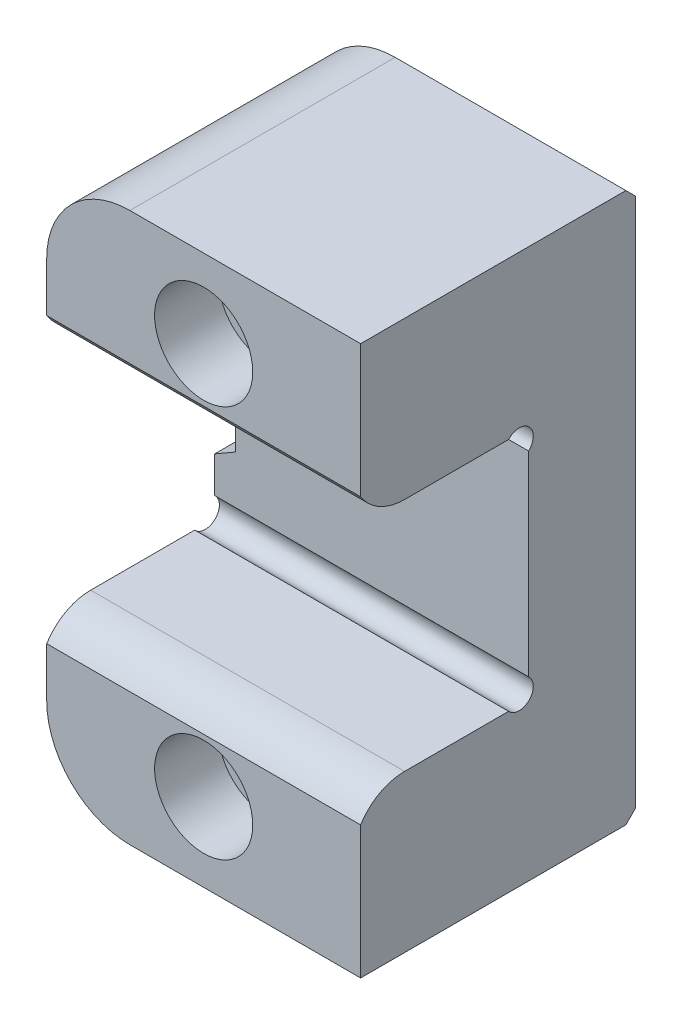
ISO-10303-21;
HEADER;
FILE_DESCRIPTION(('STEP AP214'),'2;1');
FILE_NAME('part.step','',(''),(''),'','','');
FILE_SCHEMA(('AUTOMOTIVE_DESIGN { 1 0 10303 214 1 1 1 1 }'));
ENDSEC;
DATA;
#1=APPLICATION_CONTEXT('core data for automotive mechanical design processes');
#2=APPLICATION_PROTOCOL_DEFINITION('international standard','automotive_design',2000,#1);
#3=PRODUCT_CONTEXT('',#1,'mechanical');
#4=PRODUCT('Part','Part','',(#3));
#5=PRODUCT_RELATED_PRODUCT_CATEGORY('part','',(#4));
#6=PRODUCT_DEFINITION_FORMATION('','',#4);
#7=PRODUCT_DEFINITION_CONTEXT('part definition',#1,'design');
#8=PRODUCT_DEFINITION('design','',#6,#7);
#9=PRODUCT_DEFINITION_SHAPE('','',#8);
#10=(LENGTH_UNIT() NAMED_UNIT(*) SI_UNIT(.MILLI.,.METRE.));
#11=(NAMED_UNIT(*) PLANE_ANGLE_UNIT() SI_UNIT($,.RADIAN.));
#12=(NAMED_UNIT(*) SI_UNIT($,.STERADIAN.) SOLID_ANGLE_UNIT());
#13=UNCERTAINTY_MEASURE_WITH_UNIT(LENGTH_MEASURE(1.E-05),#10,'distance_accuracy_value','');
#14=(GEOMETRIC_REPRESENTATION_CONTEXT(3) GLOBAL_UNCERTAINTY_ASSIGNED_CONTEXT((#13)) GLOBAL_UNIT_ASSIGNED_CONTEXT((#10,
#11,#12)) REPRESENTATION_CONTEXT('',''));
#15=CARTESIAN_POINT('',(0.,0.,0.));
#16=DIRECTION('',(0.,0.,1.));
#17=DIRECTION('',(1.,0.,0.));
#18=AXIS2_PLACEMENT_3D('',#15,#16,#17);
#19=CARTESIAN_POINT('',(25.4,19.05,-27.178));
#20=DIRECTION('',(0.,0.,-1.));
#21=DIRECTION('',(-1.,0.,0.));
#22=AXIS2_PLACEMENT_3D('',#19,#20,#21);
#23=PLANE('',#22);
#24=DIRECTION('',(-0.866025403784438,0.500000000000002,0.));
#25=VECTOR('',#24,1.);
#26=CARTESIAN_POINT('',(8.7739915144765,-9.74709142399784,-27.178));
#27=LINE('',#26,#25);
#28=CARTESIAN_POINT('',(-21.9978635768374,8.0190473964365,-27.178));
#29=VERTEX_POINT('',#28);
#30=CARTESIAN_POINT('',(-25.4,9.98327177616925,-27.178));
#31=VERTEX_POINT('',#30);
#32=EDGE_CURVE('E340',#29,#31,#27,.T.);
#33=ORIENTED_EDGE('',*,*,#32,.F.);
#34=DIRECTION('',(0.,-1.,0.));
#35=VECTOR('',#34,1.);
#36=CARTESIAN_POINT('',(-21.9978635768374,-8.60845644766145,-27.178));
#37=LINE('',#36,#35);
#38=CARTESIAN_POINT('',(-21.9978635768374,-8.0190473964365,-27.178));
#39=VERTEX_POINT('',#38);
#40=EDGE_CURVE('E255',#29,#39,#37,.T.);
#41=ORIENTED_EDGE('',*,*,#40,.T.);
#42=DIRECTION('',(0.866025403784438,0.500000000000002,0.));
#43=VECTOR('',#42,1.);
#44=CARTESIAN_POINT('',(25.2717754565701,19.2720914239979,-27.178));
#45=LINE('',#44,#43);
#46=CARTESIAN_POINT('',(-25.4,-9.98327177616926,-27.178));
#47=VERTEX_POINT('',#46);
#48=EDGE_CURVE('E338',#47,#39,#45,.T.);
#49=ORIENTED_EDGE('',*,*,#48,.F.);
#50=DIRECTION('',(0.,-1.,0.));
#51=VECTOR('',#50,1.);
#52=CARTESIAN_POINT('',(-25.4,19.05,-27.178));
#53=LINE('',#52,#51);
#54=CARTESIAN_POINT('',(-25.4,-15.8221162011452,-27.178));
#55=VERTEX_POINT('',#54);
#56=EDGE_CURVE('E221',#47,#55,#53,.T.);
#57=ORIENTED_EDGE('',*,*,#56,.T.);
#58=DIRECTION('',(1.,0.,0.));
#59=VECTOR('',#58,1.);
#60=CARTESIAN_POINT('',(-25.4,-15.8221162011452,-27.178));
#61=LINE('',#60,#59);
#62=CARTESIAN_POINT('',(25.4,-15.8221162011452,-27.178));
#63=VERTEX_POINT('',#62);
#64=EDGE_CURVE('E194',#55,#63,#61,.T.);
#65=ORIENTED_EDGE('',*,*,#64,.T.);
#66=DIRECTION('',(0.,-1.,0.));
#67=VECTOR('',#66,1.);
#68=CARTESIAN_POINT('',(25.4,19.05,-27.178));
#69=LINE('',#68,#67);
#70=CARTESIAN_POINT('',(25.4,15.8221162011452,-27.178));
#71=VERTEX_POINT('',#70);
#72=EDGE_CURVE('E348',#71,#63,#69,.T.);
#73=ORIENTED_EDGE('',*,*,#72,.F.);
#74=DIRECTION('',(1.,0.,0.));
#75=VECTOR('',#74,1.);
#76=CARTESIAN_POINT('',(-25.4,15.8221162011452,-27.178));
#77=LINE('',#76,#75);
#78=CARTESIAN_POINT('',(-25.4,15.8221162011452,-27.178));
#79=VERTEX_POINT('',#78);
#80=EDGE_CURVE('E416',#71,#79,#77,.F.);
#81=ORIENTED_EDGE('',*,*,#80,.T.);
#82=EDGE_CURVE('E215',#79,#31,#53,.T.);
#83=ORIENTED_EDGE('',*,*,#82,.T.);
#84=EDGE_LOOP('',(#33,#41,#49,#57,#65,#73,#81,#83));
#85=FACE_BOUND('',#84,.T.);
#86=ADVANCED_FACE('F32',(#85),#23,.F.);
#87=CARTESIAN_POINT('',(25.4,44.45,-44.45));
#88=DIRECTION('',(0.,0.,1.));
#89=DIRECTION('',(1.,0.,0.));
#90=AXIS2_PLACEMENT_3D('',#87,#88,#89);
#91=PLANE('',#90);
#92=CARTESIAN_POINT('',(0.,31.75,-44.45));
#93=DIRECTION('',(0.,0.,1.));
#94=DIRECTION('',(1.,0.,0.));
#95=AXIS2_PLACEMENT_3D('',#92,#93,#94);
#96=CIRCLE('',#95,5.15873999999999);
#97=CARTESIAN_POINT('',(5.15873999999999,31.75,-44.45));
#98=VERTEX_POINT('',#97);
#99=EDGE_CURVE('E723',#98,#98,#96,.T.);
#100=ORIENTED_EDGE('',*,*,#99,.T.);
#101=EDGE_LOOP('',(#100));
#102=FACE_BOUND('',#101,.T.);
#103=CARTESIAN_POINT('',(0.,-31.75,-44.45));
#104=DIRECTION('',(0.,0.,1.));
#105=DIRECTION('',(1.,0.,0.));
#106=AXIS2_PLACEMENT_3D('',#103,#104,#105);
#107=CIRCLE('',#106,5.15873999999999);
#108=CARTESIAN_POINT('',(5.15873999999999,-31.75,-44.45));
#109=VERTEX_POINT('',#108);
#110=EDGE_CURVE('E709',#109,#109,#107,.T.);
#111=ORIENTED_EDGE('',*,*,#110,.T.);
#112=EDGE_LOOP('',(#111));
#113=FACE_BOUND('',#112,.T.);
#114=CARTESIAN_POINT('',(-11.938,-30.988,-44.45));
#115=DIRECTION('',(0.,0.,1.));
#116=DIRECTION('',(1.,0.,0.));
#117=AXIS2_PLACEMENT_3D('',#114,#115,#116);
#118=CIRCLE('',#117,11.938);
#119=CARTESIAN_POINT('',(-11.938,-42.926,-44.45));
#120=VERTEX_POINT('',#119);
#121=CARTESIAN_POINT('',(-23.876,-30.988,-44.45));
#122=VERTEX_POINT('',#121);
#123=EDGE_CURVE('E271',#120,#122,#118,.F.);
#124=ORIENTED_EDGE('',*,*,#123,.T.);
#125=DIRECTION('',(0.,1.,0.));
#126=VECTOR('',#125,1.);
#127=CARTESIAN_POINT('',(-23.876,-9.98327177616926,-44.45));
#128=LINE('',#127,#126);
#129=CARTESIAN_POINT('',(-23.876,-9.10338996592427,-44.45));
#130=VERTEX_POINT('',#129);
#131=EDGE_CURVE('E273',#122,#130,#128,.T.);
#132=ORIENTED_EDGE('',*,*,#131,.T.);
#133=DIRECTION('',(0.866025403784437,0.500000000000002,0.));
#134=VECTOR('',#133,1.);
#135=CARTESIAN_POINT('',(-23.01875,-8.60845644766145,-44.45));
#136=LINE('',#135,#134);
#137=CARTESIAN_POINT('',(-23.01875,-8.60845644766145,-44.45));
#138=VERTEX_POINT('',#137);
#139=EDGE_CURVE('E324',#130,#138,#136,.T.);
#140=ORIENTED_EDGE('',*,*,#139,.T.);
#141=DIRECTION('',(0.,1.,0.));
#142=VECTOR('',#141,1.);
#143=CARTESIAN_POINT('',(-23.01875,8.60845644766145,-44.45));
#144=LINE('',#143,#142);
#145=CARTESIAN_POINT('',(-23.01875,8.60845644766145,-44.45));
#146=VERTEX_POINT('',#145);
#147=EDGE_CURVE('E323',#138,#146,#144,.T.);
#148=ORIENTED_EDGE('',*,*,#147,.T.);
#149=DIRECTION('',(-0.866025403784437,0.500000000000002,0.));
#150=VECTOR('',#149,1.);
#151=CARTESIAN_POINT('',(-23.01875,8.60845644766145,-44.45));
#152=LINE('',#151,#150);
#153=CARTESIAN_POINT('',(-23.876,9.10338996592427,-44.45));
#154=VERTEX_POINT('',#153);
#155=EDGE_CURVE('E317',#146,#154,#152,.T.);
#156=ORIENTED_EDGE('',*,*,#155,.T.);
#157=DIRECTION('',(0.,1.,0.));
#158=VECTOR('',#157,1.);
#159=CARTESIAN_POINT('',(-23.876,30.988,-44.45));
#160=LINE('',#159,#158);
#161=CARTESIAN_POINT('',(-23.876,30.988,-44.45));
#162=VERTEX_POINT('',#161);
#163=EDGE_CURVE('E265',#154,#162,#160,.T.);
#164=ORIENTED_EDGE('',*,*,#163,.T.);
#165=CARTESIAN_POINT('',(-11.938,30.988,-44.45));
#166=DIRECTION('',(0.,0.,1.));
#167=DIRECTION('',(1.,0.,0.));
#168=AXIS2_PLACEMENT_3D('',#165,#166,#167);
#169=CIRCLE('',#168,11.938);
#170=CARTESIAN_POINT('',(-11.938,42.926,-44.45));
#171=VERTEX_POINT('',#170);
#172=EDGE_CURVE('E263',#162,#171,#169,.F.);
#173=ORIENTED_EDGE('',*,*,#172,.T.);
#174=DIRECTION('',(1.,0.,0.));
#175=VECTOR('',#174,1.);
#176=CARTESIAN_POINT('',(25.4,42.926,-44.45));
#177=LINE('',#176,#175);
#178=CARTESIAN_POINT('',(25.4,42.926,-44.45));
#179=VERTEX_POINT('',#178);
#180=EDGE_CURVE('E267',#171,#179,#177,.T.);
#181=ORIENTED_EDGE('',*,*,#180,.T.);
#182=DIRECTION('',(0.,1.,0.));
#183=VECTOR('',#182,1.);
#184=CARTESIAN_POINT('',(25.4,44.45,-44.45));
#185=LINE('',#184,#183);
#186=CARTESIAN_POINT('',(25.4,-42.926,-44.45));
#187=VERTEX_POINT('',#186);
#188=EDGE_CURVE('E357',#187,#179,#185,.T.);
#189=ORIENTED_EDGE('',*,*,#188,.F.);
#190=DIRECTION('',(-1.,0.,0.));
#191=VECTOR('',#190,1.);
#192=CARTESIAN_POINT('',(25.4,-42.926,-44.45));
#193=LINE('',#192,#191);
#194=EDGE_CURVE('E269',#187,#120,#193,.T.);
#195=ORIENTED_EDGE('',*,*,#194,.T.);
#196=EDGE_LOOP('',(#124,#132,#140,#148,#156,#164,#173,#181,#189,#195));
#197=FACE_BOUND('',#196,.T.);
#198=ADVANCED_FACE('F321',(#102,#113,#197),#91,.F.);
#199=CARTESIAN_POINT('',(-25.4,-19.05,0.));
#200=DIRECTION('',(-1.,0.,0.));
#201=DIRECTION('',(0.,0.,1.));
#202=AXIS2_PLACEMENT_3D('',#199,#200,#201);
#203=PLANE('',#202);
#204=DIRECTION('',(0.,0.,1.));
#205=VECTOR('',#204,1.);
#206=CARTESIAN_POINT('',(-25.4,30.988,-44.45));
#207=LINE('',#206,#205);
#208=CARTESIAN_POINT('',(-25.4,30.988,0.));
#209=VERTEX_POINT('',#208);
#210=CARTESIAN_POINT('',(-25.4,30.988,-42.926));
#211=VERTEX_POINT('',#210);
#212=EDGE_CURVE('E235',#209,#211,#207,.F.);
#213=ORIENTED_EDGE('',*,*,#212,.T.);
#214=DIRECTION('',(0.,-1.,0.));
#215=VECTOR('',#214,1.);
#216=CARTESIAN_POINT('',(-25.4,9.98327177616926,-42.926));
#217=LINE('',#216,#215);
#218=CARTESIAN_POINT('',(-25.4,9.98327177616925,-42.926));
#219=VERTEX_POINT('',#218);
#220=EDGE_CURVE('E49',#211,#219,#217,.T.);
#221=ORIENTED_EDGE('',*,*,#220,.T.);
#222=DIRECTION('',(0.,0.,1.));
#223=VECTOR('',#222,1.);
#224=CARTESIAN_POINT('',(-25.4,9.98327177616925,0.));
#225=LINE('',#224,#223);
#226=EDGE_CURVE('E247',#219,#31,#225,.T.);
#227=ORIENTED_EDGE('',*,*,#226,.T.);
#228=ORIENTED_EDGE('',*,*,#82,.F.);
#229=CARTESIAN_POINT('',(-25.4,17.526,-25.654));
#230=DIRECTION('',(1.,0.,0.));
#231=DIRECTION('',(0.,0.,-1.));
#232=AXIS2_PLACEMENT_3D('',#229,#230,#231);
#233=CIRCLE('',#232,2.286);
#234=CARTESIAN_POINT('',(-25.4,19.05,-23.9501162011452));
#235=VERTEX_POINT('',#234);
#236=EDGE_CURVE('E423',#79,#235,#233,.T.);
#237=ORIENTED_EDGE('',*,*,#236,.T.);
#238=DIRECTION('',(0.,0.,-1.));
#239=VECTOR('',#238,1.);
#240=CARTESIAN_POINT('',(-25.4,19.05,0.));
#241=LINE('',#240,#239);
#242=CARTESIAN_POINT('',(-25.4,19.05,-7.11199999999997));
#243=VERTEX_POINT('',#242);
#244=EDGE_CURVE('E362',#243,#235,#241,.T.);
#245=ORIENTED_EDGE('',*,*,#244,.F.);
#246=CARTESIAN_POINT('',(-25.4,27.4328930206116,-7.11199999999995));
#247=DIRECTION('',(-1.,0.,0.));
#248=DIRECTION('',(0.,0.,-1.));
#249=AXIS2_PLACEMENT_3D('',#246,#247,#248);
#250=CIRCLE('',#249,8.38289302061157);
#251=CARTESIAN_POINT('',(-25.4,22.995286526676,0.));
#252=VERTEX_POINT('',#251);
#253=EDGE_CURVE('E415',#243,#252,#250,.T.);
#254=ORIENTED_EDGE('',*,*,#253,.T.);
#255=DIRECTION('',(0.,-1.,0.));
#256=VECTOR('',#255,1.);
#257=CARTESIAN_POINT('',(-25.4,44.45,0.));
#258=LINE('',#257,#256);
#259=EDGE_CURVE('E342',#209,#252,#258,.T.);
#260=ORIENTED_EDGE('',*,*,#259,.F.);
#261=EDGE_LOOP('',(#213,#221,#227,#228,#237,#245,#254,#260));
#262=FACE_BOUND('',#261,.T.);
#263=ADVANCED_FACE('F459',(#262),#203,.T.);
#264=DIRECTION('',(0.,0.,-1.));
#265=VECTOR('',#264,1.);
#266=CARTESIAN_POINT('',(-25.4,-9.98327177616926,0.));
#267=LINE('',#266,#265);
#268=CARTESIAN_POINT('',(-25.4,-9.98327177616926,-42.926));
#269=VERTEX_POINT('',#268);
#270=EDGE_CURVE('E245',#47,#269,#267,.T.);
#271=ORIENTED_EDGE('',*,*,#270,.T.);
#272=DIRECTION('',(0.,-1.,0.));
#273=VECTOR('',#272,1.);
#274=CARTESIAN_POINT('',(-25.4,-30.988,-42.926));
#275=LINE('',#274,#273);
#276=CARTESIAN_POINT('',(-25.4,-30.988,-42.926));
#277=VERTEX_POINT('',#276);
#278=EDGE_CURVE('E278',#269,#277,#275,.T.);
#279=ORIENTED_EDGE('',*,*,#278,.T.);
#280=DIRECTION('',(0.,0.,-1.));
#281=VECTOR('',#280,1.);
#282=CARTESIAN_POINT('',(-25.4,-30.988,0.));
#283=LINE('',#282,#281);
#284=CARTESIAN_POINT('',(-25.4,-30.988,0.));
#285=VERTEX_POINT('',#284);
#286=EDGE_CURVE('E237',#277,#285,#283,.F.);
#287=ORIENTED_EDGE('',*,*,#286,.T.);
#288=DIRECTION('',(0.,-1.,0.));
#289=VECTOR('',#288,1.);
#290=CARTESIAN_POINT('',(-25.4,-19.05,0.));
#291=LINE('',#290,#289);
#292=CARTESIAN_POINT('',(-25.4,-22.995286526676,0.));
#293=VERTEX_POINT('',#292);
#294=EDGE_CURVE('E214',#293,#285,#291,.T.);
#295=ORIENTED_EDGE('',*,*,#294,.F.);
#296=CARTESIAN_POINT('',(-25.4,-27.4328930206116,-7.11199999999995));
#297=DIRECTION('',(-1.,0.,0.));
#298=DIRECTION('',(0.,0.,1.));
#299=AXIS2_PLACEMENT_3D('',#296,#297,#298);
#300=CIRCLE('',#299,8.38289302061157);
#301=CARTESIAN_POINT('',(-25.4,-19.05,-7.11199999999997));
#302=VERTEX_POINT('',#301);
#303=EDGE_CURVE('E213',#293,#302,#300,.T.);
#304=ORIENTED_EDGE('',*,*,#303,.T.);
#305=DIRECTION('',(0.,0.,1.));
#306=VECTOR('',#305,1.);
#307=CARTESIAN_POINT('',(-25.4,-19.05,-27.178));
#308=LINE('',#307,#306);
#309=CARTESIAN_POINT('',(-25.4,-19.05,-23.9501162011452));
#310=VERTEX_POINT('',#309);
#311=EDGE_CURVE('E205',#310,#302,#308,.T.);
#312=ORIENTED_EDGE('',*,*,#311,.F.);
#313=CARTESIAN_POINT('',(-25.4,-17.526,-25.654));
#314=DIRECTION('',(1.,0.,0.));
#315=DIRECTION('',(0.,0.,1.));
#316=AXIS2_PLACEMENT_3D('',#313,#314,#315);
#317=CIRCLE('',#316,2.286);
#318=EDGE_CURVE('E188',#310,#55,#317,.T.);
#319=ORIENTED_EDGE('',*,*,#318,.T.);
#320=ORIENTED_EDGE('',*,*,#56,.F.);
#321=EDGE_LOOP('',(#271,#279,#287,#295,#304,#312,#319,#320));
#322=FACE_BOUND('',#321,.T.);
#323=ADVANCED_FACE('F211',(#322),#203,.T.);
#324=CARTESIAN_POINT('',(25.4,44.45,0.));
#325=DIRECTION('',(0.,0.,-1.));
#326=DIRECTION('',(0.,1.,0.));
#327=AXIS2_PLACEMENT_3D('',#324,#325,#326);
#328=PLANE('',#327);
#329=CARTESIAN_POINT('',(0.,31.75,0.));
#330=DIRECTION('',(0.,0.,1.));
#331=DIRECTION('',(1.,0.,0.));
#332=AXIS2_PLACEMENT_3D('',#329,#330,#331);
#333=CIRCLE('',#332,7.9375);
#334=CARTESIAN_POINT('',(7.9375,31.75,0.));
#335=VERTEX_POINT('',#334);
#336=EDGE_CURVE('E298',#335,#335,#333,.T.);
#337=ORIENTED_EDGE('',*,*,#336,.F.);
#338=EDGE_LOOP('',(#337));
#339=FACE_BOUND('',#338,.T.);
#340=ORIENTED_EDGE('',*,*,#259,.T.);
#341=DIRECTION('',(1.,0.,0.));
#342=VECTOR('',#341,1.);
#343=CARTESIAN_POINT('',(-25.4,22.995286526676,0.));
#344=LINE('',#343,#342);
#345=CARTESIAN_POINT('',(25.4,22.995286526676,0.));
#346=VERTEX_POINT('',#345);
#347=EDGE_CURVE('E410',#252,#346,#344,.T.);
#348=ORIENTED_EDGE('',*,*,#347,.T.);
#349=DIRECTION('',(0.,-1.,0.));
#350=VECTOR('',#349,1.);
#351=CARTESIAN_POINT('',(25.4,44.45,0.));
#352=LINE('',#351,#350);
#353=CARTESIAN_POINT('',(25.4,44.45,0.));
#354=VERTEX_POINT('',#353);
#355=EDGE_CURVE('E218',#354,#346,#352,.T.);
#356=ORIENTED_EDGE('',*,*,#355,.F.);
#357=DIRECTION('',(-1.,0.,0.));
#358=VECTOR('',#357,1.);
#359=CARTESIAN_POINT('',(25.4,44.45,0.));
#360=LINE('',#359,#358);
#361=CARTESIAN_POINT('',(-11.938,44.45,0.));
#362=VERTEX_POINT('',#361);
#363=EDGE_CURVE('E225',#354,#362,#360,.T.);
#364=ORIENTED_EDGE('',*,*,#363,.T.);
#365=CARTESIAN_POINT('',(-11.938,30.988,0.));
#366=DIRECTION('',(0.,0.,-1.));
#367=DIRECTION('',(0.,1.,0.));
#368=AXIS2_PLACEMENT_3D('',#365,#366,#367);
#369=CIRCLE('',#368,13.462);
#370=EDGE_CURVE('E243',#362,#209,#369,.F.);
#371=ORIENTED_EDGE('',*,*,#370,.T.);
#372=EDGE_LOOP('',(#340,#348,#356,#364,#371));
#373=FACE_BOUND('',#372,.T.);
#374=ADVANCED_FACE('F409',(#339,#373),#328,.F.);
#375=CARTESIAN_POINT('',(25.4,19.05,0.));
#376=DIRECTION('',(0.,1.,0.));
#377=DIRECTION('',(0.,0.,1.));
#378=AXIS2_PLACEMENT_3D('',#375,#376,#377);
#379=PLANE('',#378);
#380=ORIENTED_EDGE('',*,*,#244,.T.);
#381=DIRECTION('',(1.,0.,0.));
#382=VECTOR('',#381,1.);
#383=CARTESIAN_POINT('',(-25.4,19.05,-23.9501162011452));
#384=LINE('',#383,#382);
#385=CARTESIAN_POINT('',(25.4,19.05,-23.9501162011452));
#386=VERTEX_POINT('',#385);
#387=EDGE_CURVE('E420',#235,#386,#384,.T.);
#388=ORIENTED_EDGE('',*,*,#387,.T.);
#389=DIRECTION('',(0.,0.,-1.));
#390=VECTOR('',#389,1.);
#391=CARTESIAN_POINT('',(25.4,19.05,0.));
#392=LINE('',#391,#390);
#393=CARTESIAN_POINT('',(25.4,19.05,-7.11199999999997));
#394=VERTEX_POINT('',#393);
#395=EDGE_CURVE('E345',#394,#386,#392,.T.);
#396=ORIENTED_EDGE('',*,*,#395,.F.);
#397=DIRECTION('',(1.,0.,0.));
#398=VECTOR('',#397,1.);
#399=CARTESIAN_POINT('',(-25.4,19.05,-7.11199999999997));
#400=LINE('',#399,#398);
#401=EDGE_CURVE('E419',#243,#394,#400,.T.);
#402=ORIENTED_EDGE('',*,*,#401,.F.);
#403=EDGE_LOOP('',(#380,#388,#396,#402));
#404=FACE_BOUND('',#403,.T.);
#405=ADVANCED_FACE('F418',(#404),#379,.F.);
#406=CARTESIAN_POINT('',(25.4,-19.05,-27.178));
#407=DIRECTION('',(0.,-1.,0.));
#408=DIRECTION('',(0.,0.,-1.));
#409=AXIS2_PLACEMENT_3D('',#406,#407,#408);
#410=PLANE('',#409);
#411=DIRECTION('',(0.,0.,1.));
#412=VECTOR('',#411,1.);
#413=CARTESIAN_POINT('',(25.4,-19.05,-27.178));
#414=LINE('',#413,#412);
#415=CARTESIAN_POINT('',(25.4,-19.05,-23.9501162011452));
#416=VERTEX_POINT('',#415);
#417=CARTESIAN_POINT('',(25.4,-19.05,-7.11199999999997));
#418=VERTEX_POINT('',#417);
#419=EDGE_CURVE('E207',#416,#418,#414,.T.);
#420=ORIENTED_EDGE('',*,*,#419,.F.);
#421=DIRECTION('',(1.,0.,0.));
#422=VECTOR('',#421,1.);
#423=CARTESIAN_POINT('',(-25.4,-19.05,-23.9501162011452));
#424=LINE('',#423,#422);
#425=EDGE_CURVE('E191',#416,#310,#424,.F.);
#426=ORIENTED_EDGE('',*,*,#425,.T.);
#427=ORIENTED_EDGE('',*,*,#311,.T.);
#428=DIRECTION('',(1.,0.,0.));
#429=VECTOR('',#428,1.);
#430=CARTESIAN_POINT('',(-25.4,-19.05,-7.11199999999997));
#431=LINE('',#430,#429);
#432=EDGE_CURVE('E328',#302,#418,#431,.T.);
#433=ORIENTED_EDGE('',*,*,#432,.T.);
#434=EDGE_LOOP('',(#420,#426,#427,#433));
#435=FACE_BOUND('',#434,.T.);
#436=ADVANCED_FACE('F203',(#435),#410,.F.);
#437=CARTESIAN_POINT('',(25.4,-19.05,0.));
#438=DIRECTION('',(0.,0.,-1.));
#439=DIRECTION('',(0.,1.,0.));
#440=AXIS2_PLACEMENT_3D('',#437,#438,#439);
#441=PLANE('',#440);
#442=CARTESIAN_POINT('',(0.,-31.75,0.));
#443=DIRECTION('',(0.,0.,1.));
#444=DIRECTION('',(1.,0.,0.));
#445=AXIS2_PLACEMENT_3D('',#442,#443,#444);
#446=CIRCLE('',#445,7.9375);
#447=CARTESIAN_POINT('',(7.9375,-31.75,0.));
#448=VERTEX_POINT('',#447);
#449=EDGE_CURVE('E720',#448,#448,#446,.T.);
#450=ORIENTED_EDGE('',*,*,#449,.F.);
#451=EDGE_LOOP('',(#450));
#452=FACE_BOUND('',#451,.T.);
#453=DIRECTION('',(0.,-1.,0.));
#454=VECTOR('',#453,1.);
#455=CARTESIAN_POINT('',(25.4,-19.05,0.));
#456=LINE('',#455,#454);
#457=CARTESIAN_POINT('',(25.4,-22.995286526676,0.));
#458=VERTEX_POINT('',#457);
#459=CARTESIAN_POINT('',(25.4,-44.45,0.));
#460=VERTEX_POINT('',#459);
#461=EDGE_CURVE('E352',#458,#460,#456,.T.);
#462=ORIENTED_EDGE('',*,*,#461,.F.);
#463=DIRECTION('',(1.,0.,0.));
#464=VECTOR('',#463,1.);
#465=CARTESIAN_POINT('',(-25.4,-22.995286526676,0.));
#466=LINE('',#465,#464);
#467=EDGE_CURVE('E325',#293,#458,#466,.T.);
#468=ORIENTED_EDGE('',*,*,#467,.F.);
#469=ORIENTED_EDGE('',*,*,#294,.T.);
#470=CARTESIAN_POINT('',(-11.938,-30.988,0.));
#471=DIRECTION('',(0.,0.,-1.));
#472=DIRECTION('',(0.,1.,0.));
#473=AXIS2_PLACEMENT_3D('',#470,#471,#472);
#474=CIRCLE('',#473,13.462);
#475=CARTESIAN_POINT('',(-11.938,-44.45,0.));
#476=VERTEX_POINT('',#475);
#477=EDGE_CURVE('E239',#285,#476,#474,.F.);
#478=ORIENTED_EDGE('',*,*,#477,.T.);
#479=DIRECTION('',(-1.,0.,0.));
#480=VECTOR('',#479,1.);
#481=CARTESIAN_POINT('',(25.4,-44.45,0.));
#482=LINE('',#481,#480);
#483=EDGE_CURVE('E228',#460,#476,#482,.T.);
#484=ORIENTED_EDGE('',*,*,#483,.F.);
#485=EDGE_LOOP('',(#462,#468,#469,#478,#484));
#486=FACE_BOUND('',#485,.T.);
#487=ADVANCED_FACE('F443',(#452,#486),#441,.F.);
#488=CARTESIAN_POINT('',(25.4,-44.45,0.));
#489=DIRECTION('',(0.,1.,0.));
#490=DIRECTION('',(0.,0.,1.));
#491=AXIS2_PLACEMENT_3D('',#488,#489,#490);
#492=PLANE('',#491);
#493=DIRECTION('',(0.,0.,-1.));
#494=VECTOR('',#493,1.);
#495=CARTESIAN_POINT('',(-11.938,-44.45,-44.45));
#496=LINE('',#495,#494);
#497=CARTESIAN_POINT('',(-11.938,-44.45,-42.926));
#498=VERTEX_POINT('',#497);
#499=EDGE_CURVE('E232',#476,#498,#496,.T.);
#500=ORIENTED_EDGE('',*,*,#499,.T.);
#501=DIRECTION('',(1.,0.,0.));
#502=VECTOR('',#501,1.);
#503=CARTESIAN_POINT('',(25.4,-44.45,-42.926));
#504=LINE('',#503,#502);
#505=CARTESIAN_POINT('',(25.4,-44.45,-42.926));
#506=VERTEX_POINT('',#505);
#507=EDGE_CURVE('E282',#498,#506,#504,.T.);
#508=ORIENTED_EDGE('',*,*,#507,.T.);
#509=DIRECTION('',(0.,0.,-1.));
#510=VECTOR('',#509,1.);
#511=CARTESIAN_POINT('',(25.4,-44.45,0.));
#512=LINE('',#511,#510);
#513=EDGE_CURVE('E354',#460,#506,#512,.T.);
#514=ORIENTED_EDGE('',*,*,#513,.F.);
#515=ORIENTED_EDGE('',*,*,#483,.T.);
#516=EDGE_LOOP('',(#500,#508,#514,#515));
#517=FACE_BOUND('',#516,.T.);
#518=ADVANCED_FACE('F389',(#517),#492,.F.);
#519=CARTESIAN_POINT('',(25.4,44.45,0.));
#520=DIRECTION('',(0.,-1.,0.));
#521=DIRECTION('',(0.,0.,-1.));
#522=AXIS2_PLACEMENT_3D('',#519,#520,#521);
#523=PLANE('',#522);
#524=DIRECTION('',(0.,0.,1.));
#525=VECTOR('',#524,1.);
#526=CARTESIAN_POINT('',(25.4,44.45,0.));
#527=LINE('',#526,#525);
#528=CARTESIAN_POINT('',(25.4,44.45,-42.926));
#529=VERTEX_POINT('',#528);
#530=EDGE_CURVE('E229',#529,#354,#527,.T.);
#531=ORIENTED_EDGE('',*,*,#530,.F.);
#532=DIRECTION('',(-1.,0.,0.));
#533=VECTOR('',#532,1.);
#534=CARTESIAN_POINT('',(25.4,44.45,-42.926));
#535=LINE('',#534,#533);
#536=CARTESIAN_POINT('',(-11.938,44.45,-42.926));
#537=VERTEX_POINT('',#536);
#538=EDGE_CURVE('E288',#529,#537,#535,.T.);
#539=ORIENTED_EDGE('',*,*,#538,.T.);
#540=DIRECTION('',(0.,0.,1.));
#541=VECTOR('',#540,1.);
#542=CARTESIAN_POINT('',(-11.938,44.45,0.));
#543=LINE('',#542,#541);
#544=EDGE_CURVE('E241',#537,#362,#543,.T.);
#545=ORIENTED_EDGE('',*,*,#544,.T.);
#546=ORIENTED_EDGE('',*,*,#363,.F.);
#547=EDGE_LOOP('',(#531,#539,#545,#546));
#548=FACE_BOUND('',#547,.T.);
#549=ADVANCED_FACE('F404',(#548),#523,.F.);
#550=CARTESIAN_POINT('',(25.4,-19.05,0.));
#551=DIRECTION('',(-1.,0.,0.));
#552=DIRECTION('',(0.,0.,1.));
#553=AXIS2_PLACEMENT_3D('',#550,#551,#552);
#554=PLANE('',#553);
#555=ORIENTED_EDGE('',*,*,#513,.T.);
#556=DIRECTION('',(0.,-0.707106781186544,0.707106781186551));
#557=VECTOR('',#556,1.);
#558=CARTESIAN_POINT('',(25.4,-42.926,-44.45));
#559=LINE('',#558,#557);
#560=EDGE_CURVE('E286',#506,#187,#559,.F.);
#561=ORIENTED_EDGE('',*,*,#560,.T.);
#562=ORIENTED_EDGE('',*,*,#188,.T.);
#563=DIRECTION('',(0.,-0.707106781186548,-0.707106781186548));
#564=VECTOR('',#563,1.);
#565=CARTESIAN_POINT('',(25.4,44.45,-42.926));
#566=LINE('',#565,#564);
#567=EDGE_CURVE('E284',#179,#529,#566,.F.);
#568=ORIENTED_EDGE('',*,*,#567,.T.);
#569=ORIENTED_EDGE('',*,*,#530,.T.);
#570=ORIENTED_EDGE('',*,*,#355,.T.);
#571=CARTESIAN_POINT('',(25.4,27.4328930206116,-7.11199999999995));
#572=DIRECTION('',(-1.,0.,0.));
#573=DIRECTION('',(0.,0.,-1.));
#574=AXIS2_PLACEMENT_3D('',#571,#572,#573);
#575=CIRCLE('',#574,8.38289302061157);
#576=EDGE_CURVE('E412',#394,#346,#575,.T.);
#577=ORIENTED_EDGE('',*,*,#576,.F.);
#578=ORIENTED_EDGE('',*,*,#395,.T.);
#579=CARTESIAN_POINT('',(25.4,17.526,-25.654));
#580=DIRECTION('',(-1.,0.,0.));
#581=DIRECTION('',(0.,0.,1.));
#582=AXIS2_PLACEMENT_3D('',#579,#580,#581);
#583=CIRCLE('',#582,2.286);
#584=EDGE_CURVE('E249',#386,#71,#583,.T.);
#585=ORIENTED_EDGE('',*,*,#584,.T.);
#586=ORIENTED_EDGE('',*,*,#72,.T.);
#587=CARTESIAN_POINT('',(25.4,-17.526,-25.654));
#588=DIRECTION('',(1.,0.,0.));
#589=DIRECTION('',(0.,0.,1.));
#590=AXIS2_PLACEMENT_3D('',#587,#588,#589);
#591=CIRCLE('',#590,2.286);
#592=EDGE_CURVE('E199',#416,#63,#591,.T.);
#593=ORIENTED_EDGE('',*,*,#592,.F.);
#594=ORIENTED_EDGE('',*,*,#419,.T.);
#595=CARTESIAN_POINT('',(25.4,-27.4328930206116,-7.11199999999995));
#596=DIRECTION('',(-1.,0.,0.));
#597=DIRECTION('',(0.,0.,1.));
#598=AXIS2_PLACEMENT_3D('',#595,#596,#597);
#599=CIRCLE('',#598,8.38289302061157);
#600=EDGE_CURVE('E433',#458,#418,#599,.T.);
#601=ORIENTED_EDGE('',*,*,#600,.F.);
#602=ORIENTED_EDGE('',*,*,#461,.T.);
#603=EDGE_LOOP('',(#555,#561,#562,#568,#569,#570,#577,#578,#585,#586,#593,#594,#601,#602));
#604=FACE_BOUND('',#603,.T.);
#605=ADVANCED_FACE('F398',(#604),#554,.F.);
#606=CARTESIAN_POINT('',(-11.938,-30.988,0.));
#607=DIRECTION('',(0.,0.,1.));
#608=DIRECTION('',(1.,0.,0.));
#609=AXIS2_PLACEMENT_3D('',#606,#607,#608);
#610=CYLINDRICAL_SURFACE('',#609,13.462);
#611=ORIENTED_EDGE('',*,*,#286,.F.);
#612=CARTESIAN_POINT('',(-11.938,-30.988,-42.926));
#613=DIRECTION('',(0.,0.,1.));
#614=DIRECTION('',(1.,0.,0.));
#615=AXIS2_PLACEMENT_3D('',#612,#613,#614);
#616=CIRCLE('',#615,13.462);
#617=EDGE_CURVE('E280',#277,#498,#616,.T.);
#618=ORIENTED_EDGE('',*,*,#617,.T.);
#619=ORIENTED_EDGE('',*,*,#499,.F.);
#620=ORIENTED_EDGE('',*,*,#477,.F.);
#621=EDGE_LOOP('',(#611,#618,#619,#620));
#622=FACE_BOUND('',#621,.T.);
#623=ADVANCED_FACE('F385',(#622),#610,.T.);
#624=CARTESIAN_POINT('',(-11.938,30.988,0.));
#625=DIRECTION('',(0.,0.,-1.));
#626=DIRECTION('',(-1.,0.,0.));
#627=AXIS2_PLACEMENT_3D('',#624,#625,#626);
#628=CYLINDRICAL_SURFACE('',#627,13.462);
#629=ORIENTED_EDGE('',*,*,#544,.F.);
#630=CARTESIAN_POINT('',(-11.938,30.988,-42.926));
#631=DIRECTION('',(0.,0.,1.));
#632=DIRECTION('',(1.,0.,0.));
#633=AXIS2_PLACEMENT_3D('',#630,#631,#632);
#634=CIRCLE('',#633,13.462);
#635=EDGE_CURVE('E11',#537,#211,#634,.T.);
#636=ORIENTED_EDGE('',*,*,#635,.T.);
#637=ORIENTED_EDGE('',*,*,#212,.F.);
#638=ORIENTED_EDGE('',*,*,#370,.F.);
#639=EDGE_LOOP('',(#629,#636,#637,#638));
#640=FACE_BOUND('',#639,.T.);
#641=ADVANCED_FACE('F470',(#640),#628,.T.);
#642=CARTESIAN_POINT('',(-23.01875,8.60845644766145,0.));
#643=DIRECTION('',(-1.,0.,0.));
#644=DIRECTION('',(0.,0.,1.));
#645=AXIS2_PLACEMENT_3D('',#642,#643,#644);
#646=PLANE('',#645);
#647=DIRECTION('',(0.,0.,-1.));
#648=VECTOR('',#647,1.);
#649=CARTESIAN_POINT('',(-23.01875,-8.60845644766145,0.));
#650=LINE('',#649,#648);
#651=CARTESIAN_POINT('',(-23.01875,-8.60845644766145,-30.9880000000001));
#652=VERTEX_POINT('',#651);
#653=EDGE_CURVE('E335',#652,#138,#650,.T.);
#654=ORIENTED_EDGE('',*,*,#653,.F.);
#655=DIRECTION('',(0.,1.,0.));
#656=VECTOR('',#655,1.);
#657=CARTESIAN_POINT('',(-23.01875,8.60845644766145,-30.9880000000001));
#658=LINE('',#657,#656);
#659=CARTESIAN_POINT('',(-23.01875,8.60845644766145,-30.9880000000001));
#660=VERTEX_POINT('',#659);
#661=EDGE_CURVE('E252',#652,#660,#658,.T.);
#662=ORIENTED_EDGE('',*,*,#661,.T.);
#663=DIRECTION('',(0.,0.,-1.));
#664=VECTOR('',#663,1.);
#665=CARTESIAN_POINT('',(-23.01875,8.60845644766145,0.));
#666=LINE('',#665,#664);
#667=EDGE_CURVE('E333',#660,#146,#666,.T.);
#668=ORIENTED_EDGE('',*,*,#667,.T.);
#669=ORIENTED_EDGE('',*,*,#147,.F.);
#670=EDGE_LOOP('',(#654,#662,#668,#669));
#671=FACE_BOUND('',#670,.T.);
#672=ADVANCED_FACE('F473',(#671),#646,.T.);
#673=CARTESIAN_POINT('',(-23.01875,8.60845644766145,0.));
#674=DIRECTION('',(-0.500000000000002,-0.866025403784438,0.));
#675=DIRECTION('',(0.866025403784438,-0.500000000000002,0.));
#676=AXIS2_PLACEMENT_3D('',#673,#674,#675);
#677=PLANE('',#676);
#678=ORIENTED_EDGE('',*,*,#226,.F.);
#679=DIRECTION('',(0.654653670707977,-0.377964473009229,-0.654653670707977));
#680=VECTOR('',#679,1.);
#681=CARTESIAN_POINT('',(-42.4361428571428,19.8190934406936,-25.8898571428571));
#682=LINE('',#681,#680);
#683=EDGE_CURVE('E41',#219,#154,#682,.T.);
#684=ORIENTED_EDGE('',*,*,#683,.T.);
#685=ORIENTED_EDGE('',*,*,#155,.F.);
#686=ORIENTED_EDGE('',*,*,#667,.F.);
#687=DIRECTION('',(0.255976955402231,-0.14778836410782,0.955319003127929));
#688=VECTOR('',#687,1.);
#689=CARTESIAN_POINT('',(-23.01875,8.60845644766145,-30.9880000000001));
#690=LINE('',#689,#688);
#691=EDGE_CURVE('E258',#660,#29,#690,.T.);
#692=ORIENTED_EDGE('',*,*,#691,.T.);
#693=ORIENTED_EDGE('',*,*,#32,.T.);
#694=EDGE_LOOP('',(#678,#684,#685,#686,#692,#693));
#695=FACE_BOUND('',#694,.T.);
#696=ADVANCED_FACE('F315',(#695),#677,.T.);
#697=CARTESIAN_POINT('',(-23.01875,-8.60845644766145,0.));
#698=DIRECTION('',(-0.500000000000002,0.866025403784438,0.));
#699=DIRECTION('',(-0.866025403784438,-0.500000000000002,0.));
#700=AXIS2_PLACEMENT_3D('',#697,#698,#699);
#701=PLANE('',#700);
#702=ORIENTED_EDGE('',*,*,#139,.F.);
#703=DIRECTION('',(-0.654653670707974,-0.377964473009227,0.65465367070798));
#704=VECTOR('',#703,1.);
#705=CARTESIAN_POINT('',(-42.4361428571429,-19.8190934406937,-25.889857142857));
#706=LINE('',#705,#704);
#707=EDGE_CURVE('E276',#130,#269,#706,.T.);
#708=ORIENTED_EDGE('',*,*,#707,.T.);
#709=ORIENTED_EDGE('',*,*,#270,.F.);
#710=ORIENTED_EDGE('',*,*,#48,.T.);
#711=DIRECTION('',(-0.255976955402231,-0.14778836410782,-0.955319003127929));
#712=VECTOR('',#711,1.);
#713=CARTESIAN_POINT('',(-22.3674270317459,-8.23241495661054,-28.557229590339));
#714=LINE('',#713,#712);
#715=EDGE_CURVE('E261',#39,#652,#714,.T.);
#716=ORIENTED_EDGE('',*,*,#715,.T.);
#717=ORIENTED_EDGE('',*,*,#653,.T.);
#718=EDGE_LOOP('',(#702,#708,#709,#710,#716,#717));
#719=FACE_BOUND('',#718,.T.);
#720=ADVANCED_FACE('F587',(#719),#701,.T.);
#721=CARTESIAN_POINT('',(-25.4,-27.4328930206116,-7.11199999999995));
#722=DIRECTION('',(1.,0.,0.));
#723=DIRECTION('',(0.,0.,-1.));
#724=AXIS2_PLACEMENT_3D('',#721,#722,#723);
#725=CYLINDRICAL_SURFACE('',#724,8.38289302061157);
#726=ORIENTED_EDGE('',*,*,#600,.T.);
#727=ORIENTED_EDGE('',*,*,#432,.F.);
#728=ORIENTED_EDGE('',*,*,#303,.F.);
#729=ORIENTED_EDGE('',*,*,#467,.T.);
#730=EDGE_LOOP('',(#726,#727,#728,#729));
#731=FACE_BOUND('',#730,.T.);
#732=ADVANCED_FACE('F439',(#731),#725,.T.);
#733=CARTESIAN_POINT('',(-25.4,27.4328930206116,-7.11199999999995));
#734=DIRECTION('',(1.,0.,0.));
#735=DIRECTION('',(0.,0.,-1.));
#736=AXIS2_PLACEMENT_3D('',#733,#734,#735);
#737=CYLINDRICAL_SURFACE('',#736,8.38289302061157);
#738=ORIENTED_EDGE('',*,*,#576,.T.);
#739=ORIENTED_EDGE('',*,*,#347,.F.);
#740=ORIENTED_EDGE('',*,*,#253,.F.);
#741=ORIENTED_EDGE('',*,*,#401,.T.);
#742=EDGE_LOOP('',(#738,#739,#740,#741));
#743=FACE_BOUND('',#742,.T.);
#744=ADVANCED_FACE('F572',(#743),#737,.T.);
#745=CARTESIAN_POINT('',(-25.4,17.526,-25.654));
#746=DIRECTION('',(1.,0.,0.));
#747=DIRECTION('',(0.,0.,-1.));
#748=AXIS2_PLACEMENT_3D('',#745,#746,#747);
#749=CYLINDRICAL_SURFACE('',#748,2.286);
#750=ORIENTED_EDGE('',*,*,#584,.F.);
#751=ORIENTED_EDGE('',*,*,#387,.F.);
#752=ORIENTED_EDGE('',*,*,#236,.F.);
#753=ORIENTED_EDGE('',*,*,#80,.F.);
#754=EDGE_LOOP('',(#750,#751,#752,#753));
#755=FACE_BOUND('',#754,.T.);
#756=ADVANCED_FACE('F564',(#755),#749,.F.);
#757=CARTESIAN_POINT('',(-25.4,-17.526,-25.654));
#758=DIRECTION('',(1.,0.,0.));
#759=DIRECTION('',(0.,0.,-1.));
#760=AXIS2_PLACEMENT_3D('',#757,#758,#759);
#761=CYLINDRICAL_SURFACE('',#760,2.286);
#762=ORIENTED_EDGE('',*,*,#318,.F.);
#763=ORIENTED_EDGE('',*,*,#425,.F.);
#764=ORIENTED_EDGE('',*,*,#592,.T.);
#765=ORIENTED_EDGE('',*,*,#64,.F.);
#766=EDGE_LOOP('',(#762,#763,#764,#765));
#767=FACE_BOUND('',#766,.T.);
#768=ADVANCED_FACE('F190',(#767),#761,.F.);
#769=CARTESIAN_POINT('',(0.,-31.75,0.));
#770=DIRECTION('',(0.,0.,1.));
#771=DIRECTION('',(1.,0.,0.));
#772=AXIS2_PLACEMENT_3D('',#769,#770,#771);
#773=CYLINDRICAL_SURFACE('',#772,5.15873999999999);
#774=ORIENTED_EDGE('',*,*,#110,.F.);
#775=EDGE_LOOP('',(#774));
#776=FACE_BOUND('',#775,.T.);
#777=CARTESIAN_POINT('',(0.,-31.75,-10.31875));
#778=DIRECTION('',(0.,0.,1.));
#779=DIRECTION('',(1.,0.,0.));
#780=AXIS2_PLACEMENT_3D('',#777,#778,#779);
#781=CIRCLE('',#780,5.15874);
#782=CARTESIAN_POINT('',(5.15874,-31.75,-10.31875));
#783=VERTEX_POINT('',#782);
#784=EDGE_CURVE('E712',#783,#783,#781,.T.);
#785=ORIENTED_EDGE('',*,*,#784,.T.);
#786=EDGE_LOOP('',(#785));
#787=FACE_BOUND('',#786,.T.);
#788=ADVANCED_FACE('F549',(#776,#787),#773,.F.);
#789=CARTESIAN_POINT('',(5.15874,-31.75,-10.31875));
#790=DIRECTION('',(0.,0.,-1.));
#791=DIRECTION('',(-1.,0.,0.));
#792=AXIS2_PLACEMENT_3D('',#789,#790,#791);
#793=PLANE('',#792);
#794=ORIENTED_EDGE('',*,*,#784,.F.);
#795=EDGE_LOOP('',(#794));
#796=FACE_BOUND('',#795,.T.);
#797=CARTESIAN_POINT('',(0.,-31.75,-10.31875));
#798=DIRECTION('',(0.,0.,1.));
#799=DIRECTION('',(1.,0.,0.));
#800=AXIS2_PLACEMENT_3D('',#797,#798,#799);
#801=CIRCLE('',#800,7.9375);
#802=CARTESIAN_POINT('',(7.9375,-31.75,-10.31875));
#803=VERTEX_POINT('',#802);
#804=EDGE_CURVE('E717',#803,#803,#801,.T.);
#805=ORIENTED_EDGE('',*,*,#804,.T.);
#806=EDGE_LOOP('',(#805));
#807=FACE_BOUND('',#806,.T.);
#808=ADVANCED_FACE('F541',(#796,#807),#793,.F.);
#809=CARTESIAN_POINT('',(0.,-31.75,0.));
#810=DIRECTION('',(0.,0.,1.));
#811=DIRECTION('',(1.,0.,0.));
#812=AXIS2_PLACEMENT_3D('',#809,#810,#811);
#813=CYLINDRICAL_SURFACE('',#812,7.9375);
#814=ORIENTED_EDGE('',*,*,#804,.F.);
#815=EDGE_LOOP('',(#814));
#816=FACE_BOUND('',#815,.T.);
#817=ORIENTED_EDGE('',*,*,#449,.T.);
#818=EDGE_LOOP('',(#817));
#819=FACE_BOUND('',#818,.T.);
#820=ADVANCED_FACE('F533',(#816,#819),#813,.F.);
#821=CARTESIAN_POINT('',(0.,31.75,0.));
#822=DIRECTION('',(0.,0.,1.));
#823=DIRECTION('',(1.,0.,0.));
#824=AXIS2_PLACEMENT_3D('',#821,#822,#823);
#825=CYLINDRICAL_SURFACE('',#824,5.15873999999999);
#826=ORIENTED_EDGE('',*,*,#99,.F.);
#827=EDGE_LOOP('',(#826));
#828=FACE_BOUND('',#827,.T.);
#829=CARTESIAN_POINT('',(0.,31.75,-10.31875));
#830=DIRECTION('',(0.,0.,1.));
#831=DIRECTION('',(1.,0.,0.));
#832=AXIS2_PLACEMENT_3D('',#829,#830,#831);
#833=CIRCLE('',#832,5.15874);
#834=CARTESIAN_POINT('',(5.15874,31.75,-10.31875));
#835=VERTEX_POINT('',#834);
#836=EDGE_CURVE('E726',#835,#835,#833,.T.);
#837=ORIENTED_EDGE('',*,*,#836,.T.);
#838=EDGE_LOOP('',(#837));
#839=FACE_BOUND('',#838,.T.);
#840=ADVANCED_FACE('F525',(#828,#839),#825,.F.);
#841=CARTESIAN_POINT('',(5.15874,31.75,-10.31875));
#842=DIRECTION('',(0.,0.,-1.));
#843=DIRECTION('',(-1.,0.,0.));
#844=AXIS2_PLACEMENT_3D('',#841,#842,#843);
#845=PLANE('',#844);
#846=ORIENTED_EDGE('',*,*,#836,.F.);
#847=EDGE_LOOP('',(#846));
#848=FACE_BOUND('',#847,.T.);
#849=CARTESIAN_POINT('',(0.,31.75,-10.31875));
#850=DIRECTION('',(0.,0.,1.));
#851=DIRECTION('',(1.,0.,0.));
#852=AXIS2_PLACEMENT_3D('',#849,#850,#851);
#853=CIRCLE('',#852,7.9375);
#854=CARTESIAN_POINT('',(7.9375,31.75,-10.31875));
#855=VERTEX_POINT('',#854);
#856=EDGE_CURVE('E729',#855,#855,#853,.T.);
#857=ORIENTED_EDGE('',*,*,#856,.T.);
#858=EDGE_LOOP('',(#857));
#859=FACE_BOUND('',#858,.T.);
#860=ADVANCED_FACE('F517',(#848,#859),#845,.F.);
#861=CARTESIAN_POINT('',(0.,31.75,0.));
#862=DIRECTION('',(0.,0.,1.));
#863=DIRECTION('',(1.,0.,0.));
#864=AXIS2_PLACEMENT_3D('',#861,#862,#863);
#865=CYLINDRICAL_SURFACE('',#864,7.9375);
#866=ORIENTED_EDGE('',*,*,#856,.F.);
#867=EDGE_LOOP('',(#866));
#868=FACE_BOUND('',#867,.T.);
#869=ORIENTED_EDGE('',*,*,#336,.T.);
#870=EDGE_LOOP('',(#869));
#871=FACE_BOUND('',#870,.T.);
#872=ADVANCED_FACE('F477',(#868,#871),#865,.F.);
#873=CARTESIAN_POINT('',(-23.01875,8.60845644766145,-30.9880000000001));
#874=DIRECTION('',(-0.965925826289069,0.,0.258819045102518));
#875=DIRECTION('',(0.258819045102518,0.,0.965925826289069));
#876=AXIS2_PLACEMENT_3D('',#873,#874,#875);
#877=PLANE('',#876);
#878=ORIENTED_EDGE('',*,*,#715,.F.);
#879=ORIENTED_EDGE('',*,*,#40,.F.);
#880=ORIENTED_EDGE('',*,*,#691,.F.);
#881=ORIENTED_EDGE('',*,*,#661,.F.);
#882=EDGE_LOOP('',(#878,#879,#880,#881));
#883=FACE_BOUND('',#882,.T.);
#884=ADVANCED_FACE('F474',(#883),#877,.T.);
#885=CARTESIAN_POINT('',(25.4,-42.926,-44.45));
#886=DIRECTION('',(0.,0.707106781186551,0.707106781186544));
#887=DIRECTION('',(0.,-0.707106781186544,0.707106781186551));
#888=AXIS2_PLACEMENT_3D('',#885,#886,#887);
#889=PLANE('',#888);
#890=ORIENTED_EDGE('',*,*,#560,.F.);
#891=ORIENTED_EDGE('',*,*,#507,.F.);
#892=DIRECTION('',(0.,-0.707106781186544,0.707106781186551));
#893=VECTOR('',#892,1.);
#894=CARTESIAN_POINT('',(-11.938,-42.926,-44.45));
#895=LINE('',#894,#893);
#896=EDGE_CURVE('E296',#120,#498,#895,.T.);
#897=ORIENTED_EDGE('',*,*,#896,.F.);
#898=ORIENTED_EDGE('',*,*,#194,.F.);
#899=EDGE_LOOP('',(#890,#891,#897,#898));
#900=FACE_BOUND('',#899,.T.);
#901=ADVANCED_FACE('F394',(#900),#889,.F.);
#902=CARTESIAN_POINT('',(-11.938,-30.988,-44.45));
#903=DIRECTION('',(0.,0.,1.));
#904=DIRECTION('',(1.,0.,0.));
#905=AXIS2_PLACEMENT_3D('',#902,#903,#904);
#906=CONICAL_SURFACE('',#905,11.938,0.785398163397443);
#907=ORIENTED_EDGE('',*,*,#896,.T.);
#908=ORIENTED_EDGE('',*,*,#617,.F.);
#909=DIRECTION('',(-0.707106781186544,0.,0.707106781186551));
#910=VECTOR('',#909,1.);
#911=CARTESIAN_POINT('',(-23.876,-30.988,-44.45));
#912=LINE('',#911,#910);
#913=EDGE_CURVE('E293',#122,#277,#912,.T.);
#914=ORIENTED_EDGE('',*,*,#913,.F.);
#915=ORIENTED_EDGE('',*,*,#123,.F.);
#916=EDGE_LOOP('',(#907,#908,#914,#915));
#917=FACE_BOUND('',#916,.T.);
#918=ADVANCED_FACE('F381',(#917),#906,.T.);
#919=CARTESIAN_POINT('',(-23.876,44.45,-44.45));
#920=DIRECTION('',(-0.707106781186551,0.,-0.707106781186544));
#921=DIRECTION('',(-0.707106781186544,0.,0.707106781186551));
#922=AXIS2_PLACEMENT_3D('',#919,#920,#921);
#923=PLANE('',#922);
#924=ORIENTED_EDGE('',*,*,#913,.T.);
#925=ORIENTED_EDGE('',*,*,#278,.F.);
#926=ORIENTED_EDGE('',*,*,#707,.F.);
#927=ORIENTED_EDGE('',*,*,#131,.F.);
#928=EDGE_LOOP('',(#924,#925,#926,#927));
#929=FACE_BOUND('',#928,.T.);
#930=ADVANCED_FACE('F375',(#929),#923,.T.);
#931=CARTESIAN_POINT('',(-23.876,44.45,-44.45));
#932=DIRECTION('',(-0.707106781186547,0.,-0.707106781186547));
#933=DIRECTION('',(-0.707106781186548,0.,0.707106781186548));
#934=AXIS2_PLACEMENT_3D('',#931,#932,#933);
#935=PLANE('',#934);
#936=ORIENTED_EDGE('',*,*,#683,.F.);
#937=ORIENTED_EDGE('',*,*,#220,.F.);
#938=DIRECTION('',(-0.707106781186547,0.,0.707106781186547));
#939=VECTOR('',#938,1.);
#940=CARTESIAN_POINT('',(-23.876,30.988,-44.45));
#941=LINE('',#940,#939);
#942=EDGE_CURVE('E36',#162,#211,#941,.T.);
#943=ORIENTED_EDGE('',*,*,#942,.F.);
#944=ORIENTED_EDGE('',*,*,#163,.F.);
#945=EDGE_LOOP('',(#936,#937,#943,#944));
#946=FACE_BOUND('',#945,.T.);
#947=ADVANCED_FACE('F34',(#946),#935,.T.);
#948=CARTESIAN_POINT('',(-11.938,30.988,-44.45));
#949=DIRECTION('',(0.,0.,1.));
#950=DIRECTION('',(1.,0.,0.));
#951=AXIS2_PLACEMENT_3D('',#948,#949,#950);
#952=CONICAL_SURFACE('',#951,11.938,0.785398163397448);
#953=ORIENTED_EDGE('',*,*,#942,.T.);
#954=ORIENTED_EDGE('',*,*,#635,.F.);
#955=DIRECTION('',(0.,0.707106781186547,0.707106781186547));
#956=VECTOR('',#955,1.);
#957=CARTESIAN_POINT('',(-11.938,42.926,-44.45));
#958=LINE('',#957,#956);
#959=EDGE_CURVE('E299',#171,#537,#958,.T.);
#960=ORIENTED_EDGE('',*,*,#959,.F.);
#961=ORIENTED_EDGE('',*,*,#172,.F.);
#962=EDGE_LOOP('',(#953,#954,#960,#961));
#963=FACE_BOUND('',#962,.T.);
#964=ADVANCED_FACE('F308',(#963),#952,.T.);
#965=CARTESIAN_POINT('',(25.4,44.45,-42.926));
#966=DIRECTION('',(0.,-0.707106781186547,0.707106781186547));
#967=DIRECTION('',(0.,-0.707106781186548,-0.707106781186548));
#968=AXIS2_PLACEMENT_3D('',#965,#966,#967);
#969=PLANE('',#968);
#970=ORIENTED_EDGE('',*,*,#567,.F.);
#971=ORIENTED_EDGE('',*,*,#180,.F.);
#972=ORIENTED_EDGE('',*,*,#959,.T.);
#973=ORIENTED_EDGE('',*,*,#538,.F.);
#974=EDGE_LOOP('',(#970,#971,#972,#973));
#975=FACE_BOUND('',#974,.T.);
#976=ADVANCED_FACE('F400',(#975),#969,.F.);
#977=CLOSED_SHELL('',(#86,#198,#263,#323,#374,#405,#436,#487,#518,#549,#605,#623,#641,#672,#696,
#720,#732,#744,#756,#768,#788,#808,#820,#840,#860,#872,#884,#901,#918,#930,#947,#964,#976));
#978=MANIFOLD_SOLID_BREP('B2',#977);
#979=ADVANCED_BREP_SHAPE_REPRESENTATION('',(#18,#978),#14);
#980=SHAPE_DEFINITION_REPRESENTATION(#9,#979);
ENDSEC;
END-ISO-10303-21;
